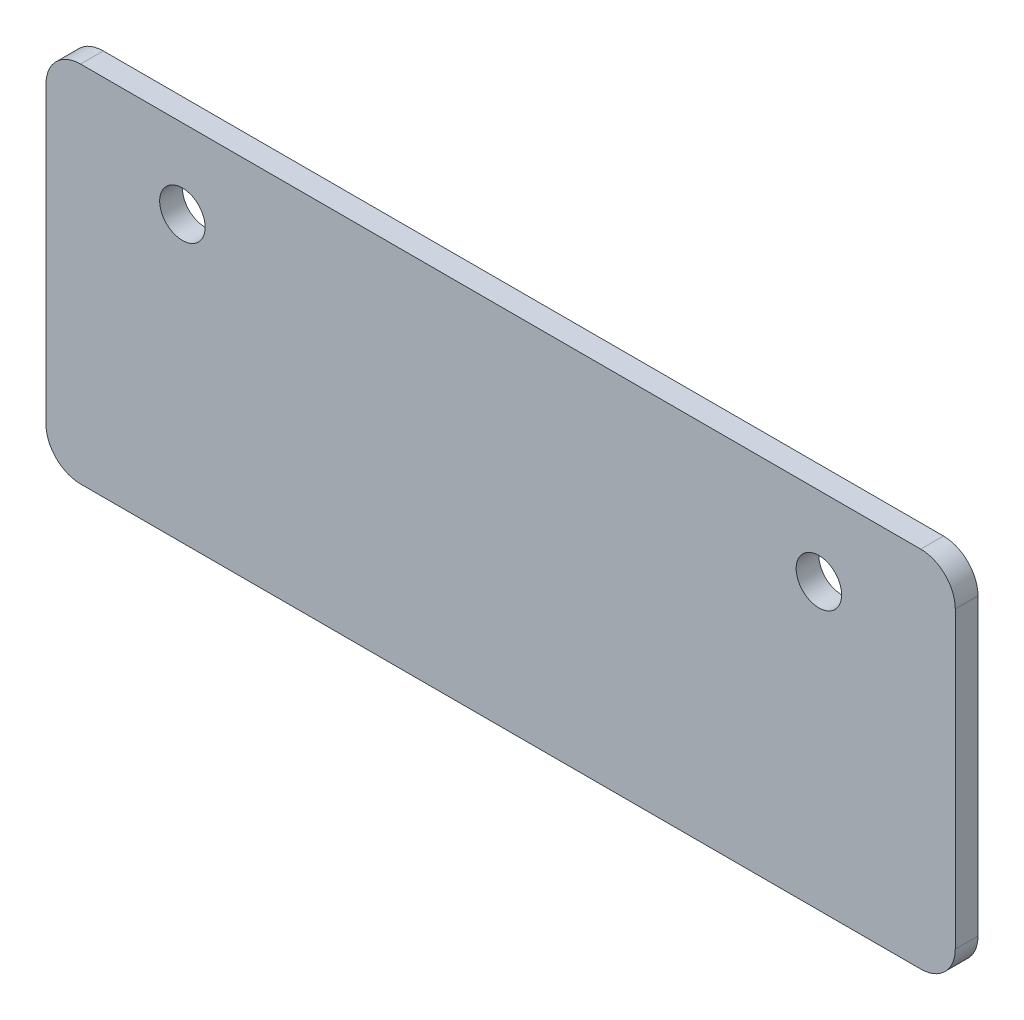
from build123d import *

# Parameters (mm, degrees)
SKETCH1_R      = 6.35
EXTRUDE1_DEPTH = 3.175


with BuildPart() as part:
    # Sketch1 → Extrude1 (new, symmetric)
    with BuildSketch(Plane.XY):
        with BuildLine():
            Line((0, -41.148), (0, 41.148))
            ThreePointArc((0, 41.148), (2.827005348, 47.972994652), (9.652, 50.8))
            Line((9.652, 50.8), (244.348, 50.8))
            ThreePointArc((244.348, 50.8), (251.172994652, 47.972994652), (254, 41.148))
            Line((254, 41.148), (254, -41.148))
            ThreePointArc((254, -41.148), (251.172994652, -47.972994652), (244.348, -50.8))
            Line((244.348, -50.8), (9.652, -50.8))
            ThreePointArc((9.652, -50.8), (2.827005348, -47.972994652), (0, -41.148))
        make_face()
        with Locations((215.9, 28.702)):
            Circle(SKETCH1_R, mode=Mode.SUBTRACT)
        with Locations((38.1, 28.702)):
            Circle(SKETCH1_R, mode=Mode.SUBTRACT)
    extrude(amount=EXTRUDE1_DEPTH, both=True)


solid = part.part
